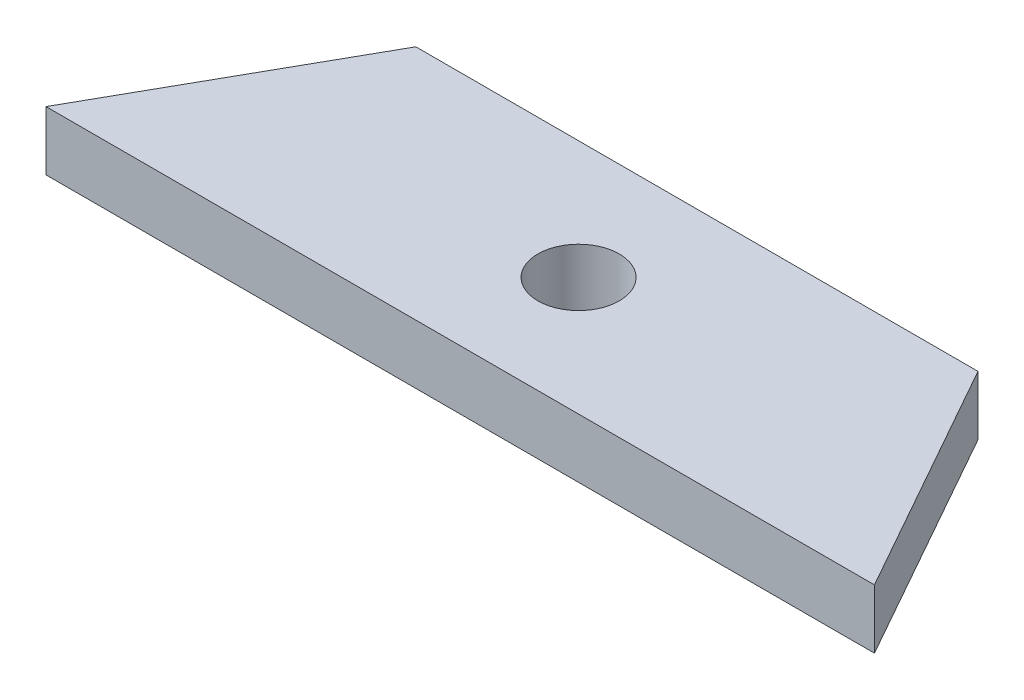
from build123d import *

# Parameters (mm, degrees)
SKETCH1_R      = 2.75
EXTRUDE1_DEPTH = 4


with BuildPart() as part:
    # Sketch1 → Extrude1 (new body)
    with BuildSketch(Plane(origin=(0, 0, 0), x_dir=(1, 0, 0), z_dir=(0, 1, 0))):
        Polygon((0, 0), (56, 0), (47, 16), (9, 16), align=None)
        with Locations(Location((28, 8, 0), (0, 0, 270))):
            Circle(SKETCH1_R, mode=Mode.SUBTRACT)
    extrude(amount=EXTRUDE1_DEPTH)


solid = part.part
